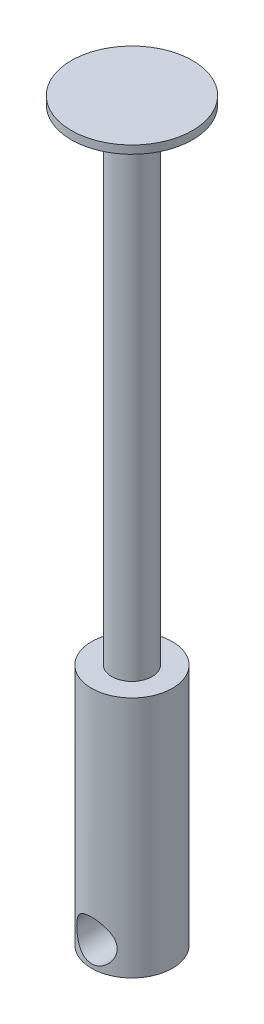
ISO-10303-21;
HEADER;
FILE_DESCRIPTION(('STEP AP214'),'2;1');
FILE_NAME('part.step','',(''),(''),'','','');
FILE_SCHEMA(('AUTOMOTIVE_DESIGN { 1 0 10303 214 1 1 1 1 }'));
ENDSEC;
DATA;
#1=APPLICATION_CONTEXT('core data for automotive mechanical design processes');
#2=APPLICATION_PROTOCOL_DEFINITION('international standard','automotive_design',2000,#1);
#3=PRODUCT_CONTEXT('',#1,'mechanical');
#4=PRODUCT('Part','Part','',(#3));
#5=PRODUCT_RELATED_PRODUCT_CATEGORY('part','',(#4));
#6=PRODUCT_DEFINITION_FORMATION('','',#4);
#7=PRODUCT_DEFINITION_CONTEXT('part definition',#1,'design');
#8=PRODUCT_DEFINITION('design','',#6,#7);
#9=PRODUCT_DEFINITION_SHAPE('','',#8);
#10=(LENGTH_UNIT() NAMED_UNIT(*) SI_UNIT(.MILLI.,.METRE.));
#11=(NAMED_UNIT(*) PLANE_ANGLE_UNIT() SI_UNIT($,.RADIAN.));
#12=(NAMED_UNIT(*) SI_UNIT($,.STERADIAN.) SOLID_ANGLE_UNIT());
#13=UNCERTAINTY_MEASURE_WITH_UNIT(LENGTH_MEASURE(1.E-05),#10,'distance_accuracy_value','');
#14=(GEOMETRIC_REPRESENTATION_CONTEXT(3) GLOBAL_UNCERTAINTY_ASSIGNED_CONTEXT((#13)) GLOBAL_UNIT_ASSIGNED_CONTEXT((#10,
#11,#12)) REPRESENTATION_CONTEXT('',''));
#15=CARTESIAN_POINT('',(0.,0.,0.));
#16=DIRECTION('',(0.,0.,1.));
#17=DIRECTION('',(1.,0.,0.));
#18=AXIS2_PLACEMENT_3D('',#15,#16,#17);
#19=CARTESIAN_POINT('',(0.,30.,0.));
#20=DIRECTION('',(0.,-1.,0.));
#21=DIRECTION('',(0.,0.,-1.));
#22=AXIS2_PLACEMENT_3D('',#19,#20,#21);
#23=CYLINDRICAL_SURFACE('',#22,5.);
#24=CARTESIAN_POINT('',(0.,5.50000000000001,-5.));
#25=CARTESIAN_POINT('',(-0.131426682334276,5.499990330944,-4.99999177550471));
#26=CARTESIAN_POINT('',(-0.263015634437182,5.48957443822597,-4.99476199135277));
#27=CARTESIAN_POINT('',(-0.522301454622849,5.44836817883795,-4.9743541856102));
#28=CARTESIAN_POINT('',(-0.649990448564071,5.41753911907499,-4.9591572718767));
#29=CARTESIAN_POINT('',(-0.897333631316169,5.33701537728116,-4.92040690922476));
#30=CARTESIAN_POINT('',(-1.01701694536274,5.28739401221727,-4.89688595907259));
#31=CARTESIAN_POINT('',(-1.24618160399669,5.17107347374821,-4.84364443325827));
#32=CARTESIAN_POINT('',(-1.35566375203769,5.10437564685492,-4.81392434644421));
#33=CARTESIAN_POINT('',(-1.56876952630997,4.95120686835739,-4.74890645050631));
#34=CARTESIAN_POINT('',(-1.67163802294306,4.86378379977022,-4.71337997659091));
#35=CARTESIAN_POINT('',(-1.8619486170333,4.67369630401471,-4.64149925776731));
#36=CARTESIAN_POINT('',(-1.94937895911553,4.5710203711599,-4.60514440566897));
#37=CARTESIAN_POINT('',(-2.11312999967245,4.34379162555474,-4.53247377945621));
#38=CARTESIAN_POINT('',(-2.18806333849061,4.218159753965,-4.49637967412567));
#39=CARTESIAN_POINT('',(-2.31542056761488,3.95408166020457,-4.43214946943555));
#40=CARTESIAN_POINT('',(-2.36786053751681,3.81564467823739,-4.40400769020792));
#41=CARTESIAN_POINT('',(-2.44533110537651,3.5383372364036,-4.36144667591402));
#42=CARTESIAN_POINT('',(-2.47181464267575,3.39998886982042,-4.34630678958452));
#43=CARTESIAN_POINT('',(-2.50106748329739,3.1200529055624,-4.3295472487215));
#44=CARTESIAN_POINT('',(-2.50386022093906,2.97846864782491,-4.32791423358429));
#45=CARTESIAN_POINT('',(-2.48671821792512,2.71428493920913,-4.33777325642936));
#46=CARTESIAN_POINT('',(-2.46946139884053,2.59143992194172,-4.34771909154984));
#47=CARTESIAN_POINT('',(-2.41734962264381,2.35069522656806,-4.37690571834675));
#48=CARTESIAN_POINT('',(-2.38248905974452,2.23279713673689,-4.39614947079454));
#49=CARTESIAN_POINT('',(-2.29552445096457,2.00192716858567,-4.44218691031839));
#50=CARTESIAN_POINT('',(-2.24303766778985,1.88913400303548,-4.46914601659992));
#51=CARTESIAN_POINT('',(-2.1226042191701,1.67341426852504,-4.52758510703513));
#52=CARTESIAN_POINT('',(-2.05465060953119,1.5704921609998,-4.55906711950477));
#53=CARTESIAN_POINT('',(-1.89516513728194,1.36369686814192,-4.62782894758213));
#54=CARTESIAN_POINT('',(-1.80173614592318,1.26135781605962,-4.66533775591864));
#55=CARTESIAN_POINT('',(-1.59888894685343,1.07316145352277,-4.73869058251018));
#56=CARTESIAN_POINT('',(-1.4894631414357,0.987312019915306,-4.77453379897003));
#57=CARTESIAN_POINT('',(-1.25129126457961,0.830785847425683,-4.84254968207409));
#58=CARTESIAN_POINT('',(-1.12188397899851,0.760998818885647,-4.87447460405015));
#59=CARTESIAN_POINT('',(-0.851165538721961,0.644757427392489,-4.92894702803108));
#60=CARTESIAN_POINT('',(-0.709863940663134,0.598284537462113,-4.95150197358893));
#61=CARTESIAN_POINT('',(-0.431916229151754,0.533811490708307,-4.98310834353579));
#62=CARTESIAN_POINT('',(-0.295853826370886,0.513771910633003,-4.9931234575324));
#63=CARTESIAN_POINT('',(-0.0219489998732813,0.49633817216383,-5.00182533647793));
#64=CARTESIAN_POINT('',(0.11589254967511,0.49893328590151,-5.00051746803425));
#65=CARTESIAN_POINT('',(0.378082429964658,0.525516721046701,-4.98727980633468));
#66=CARTESIAN_POINT('',(0.502648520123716,0.547831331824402,-4.97618114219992));
#67=CARTESIAN_POINT('',(0.746017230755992,0.610595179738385,-4.94555428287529));
#68=CARTESIAN_POINT('',(0.864819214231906,0.651046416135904,-4.92602515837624));
#69=CARTESIAN_POINT('',(1.09722152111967,0.749996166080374,-4.87960628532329));
#70=CARTESIAN_POINT('',(1.21057599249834,0.808977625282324,-4.85252204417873));
#71=CARTESIAN_POINT('',(1.42615340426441,0.942768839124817,-4.7935993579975));
#72=CARTESIAN_POINT('',(1.52837157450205,1.01758533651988,-4.76175888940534));
#73=CARTESIAN_POINT('',(1.72941922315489,1.18940106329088,-4.69270553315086));
#74=CARTESIAN_POINT('',(1.82693019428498,1.28785717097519,-4.65527212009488));
#75=CARTESIAN_POINT('',(2.00464080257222,1.49981287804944,-4.58155978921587));
#76=CARTESIAN_POINT('',(2.08482846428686,1.61332279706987,-4.54528168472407));
#77=CARTESIAN_POINT('',(2.22926978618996,1.85910913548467,-4.47627980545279));
#78=CARTESIAN_POINT('',(2.29256373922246,1.99202816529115,-4.44381323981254));
#79=CARTESIAN_POINT('',(2.39520706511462,2.26877516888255,-4.38935180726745));
#80=CARTESIAN_POINT('',(2.4345872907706,2.41258881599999,-4.36734345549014));
#81=CARTESIAN_POINT('',(2.48465421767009,2.69227555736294,-4.33903752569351));
#82=CARTESIAN_POINT('',(2.49773248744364,2.82758563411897,-4.33143458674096));
#83=CARTESIAN_POINT('',(2.501722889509,3.09861766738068,-4.32913386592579));
#84=CARTESIAN_POINT('',(2.49264462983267,3.23433941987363,-4.3344304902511));
#85=CARTESIAN_POINT('',(2.45481530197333,3.48870875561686,-4.35594655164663));
#86=CARTESIAN_POINT('',(2.42802074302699,3.60775118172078,-4.37107736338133));
#87=CARTESIAN_POINT('',(2.35793843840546,3.83952029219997,-4.40927540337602));
#88=CARTESIAN_POINT('',(2.31464538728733,3.95224493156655,-4.43234518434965));
#89=CARTESIAN_POINT('',(2.20953919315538,4.17656215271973,-4.48571326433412));
#90=CARTESIAN_POINT('',(2.14667719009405,4.28756985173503,-4.5163930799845));
#91=CARTESIAN_POINT('',(2.00537808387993,4.49818624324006,-4.58088327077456));
#92=CARTESIAN_POINT('',(1.92693287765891,4.59778896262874,-4.61469526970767));
#93=CARTESIAN_POINT('',(1.74550556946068,4.79535536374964,-4.6865581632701));
#94=CARTESIAN_POINT('',(1.64070022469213,4.89164936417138,-4.7246249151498));
#95=CARTESIAN_POINT('',(1.41539785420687,5.06565584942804,-4.79694347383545));
#96=CARTESIAN_POINT('',(1.29489242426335,5.14335831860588,-4.83119321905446));
#97=CARTESIAN_POINT('',(1.03978808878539,5.2780969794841,-4.89245149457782));
#98=CARTESIAN_POINT('',(0.905095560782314,5.33498316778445,-4.91940711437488));
#99=CARTESIAN_POINT('',(0.696328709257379,5.4021838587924,-4.9517796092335));
#100=CARTESIAN_POINT('',(0.625670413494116,5.42155539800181,-4.96122314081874));
#101=CARTESIAN_POINT('',(0.482623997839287,5.4540659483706,-4.97717127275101));
#102=CARTESIAN_POINT('',(0.410236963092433,5.46720876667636,-4.98367766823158));
#103=CARTESIAN_POINT('',(0.281518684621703,5.48473747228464,-4.9923820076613));
#104=CARTESIAN_POINT('',(0.225408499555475,5.49045493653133,-4.99523288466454));
#105=CARTESIAN_POINT('',(0.112875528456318,5.49808832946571,-4.99904367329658));
#106=CARTESIAN_POINT('',(0.0564527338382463,5.50000415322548,-5.00000353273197));
#107=CARTESIAN_POINT('',(0.,5.50000000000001,-5.));
#108=B_SPLINE_CURVE_WITH_KNOTS('',3,(#24,#25,#26,#27,#28,#29,#30,#31,#32,#33,#34,#35,#36,#37,
#38,#39,#40,#41,#42,#43,#44,#45,#46,#47,#48,#49,#50,#51,#52,#53,#54,#55,#56,#57,#58,#59,#60,#61,
#62,#63,#64,#65,#66,#67,#68,#69,#70,#71,#72,#73,#74,#75,#76,#77,#78,#79,#80,#81,#82,#83,#84,#85,
#86,#87,#88,#89,#90,#91,#92,#93,#94,#95,#96,#97,#98,#99,#100,#101,#102,#103,#104,#105,#106,
#107),.UNSPECIFIED.,.T.,.F.,(4,2,2,2,2,2,2,2,2,2,2,2,2,2,2,2,2,2,2,2,2,2,2,2,2,2,2,2,2,2,2,2,2,
2,2,2,2,2,2,2,2,4),(0.,0.394060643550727,0.788870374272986,1.18215538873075,1.57540940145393,
1.99245439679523,2.40981559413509,2.85954316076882,3.30894869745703,3.73145030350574,
4.15353393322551,4.52514281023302,4.89687009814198,5.27725600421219,5.65781303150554,
6.08662353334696,6.51563836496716,6.96457555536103,7.41315542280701,7.82458226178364,
8.23581411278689,8.61517266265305,8.99457304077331,9.38482140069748,9.77523626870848,
10.2039902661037,10.6330397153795,11.0828670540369,11.53211279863,11.9382326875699,
12.3441764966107,12.7114482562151,13.0788382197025,13.4709114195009,13.8631890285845,
14.303131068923,14.7433095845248,15.1866003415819,15.407934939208,15.6291340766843,
15.7983933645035,15.9676573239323),.UNSPECIFIED.);
#109=CARTESIAN_POINT('',(0.,5.50000000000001,-5.));
#110=VERTEX_POINT('',#109);
#111=EDGE_CURVE('E36',#110,#110,#108,.T.);
#112=ORIENTED_EDGE('',*,*,#111,.T.);
#113=EDGE_LOOP('',(#112));
#114=FACE_BOUND('',#113,.T.);
#115=CARTESIAN_POINT('',(2.5,3.,4.33012701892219));
#116=CARTESIAN_POINT('',(2.4999894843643,2.86973349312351,4.33013982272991));
#117=CARTESIAN_POINT('',(2.48974954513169,2.73929727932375,4.33609541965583));
#118=CARTESIAN_POINT('',(2.44930840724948,2.48243102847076,4.35905877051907));
#119=CARTESIAN_POINT('',(2.41906526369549,2.3560099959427,4.37608974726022));
#120=CARTESIAN_POINT('',(2.34024976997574,2.11137105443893,4.41873376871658));
#121=CARTESIAN_POINT('',(2.29177485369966,1.99311342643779,4.44430111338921));
#122=CARTESIAN_POINT('',(2.17816884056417,1.76643943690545,4.50106659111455));
#123=CARTESIAN_POINT('',(2.11303684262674,1.65802360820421,4.53226502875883));
#124=CARTESIAN_POINT('',(1.96166634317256,1.44423569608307,4.5999217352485));
#125=CARTESIAN_POINT('',(1.8741300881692,1.33985216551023,4.63660159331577));
#126=CARTESIAN_POINT('',(1.68313452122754,1.1464790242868,4.70929956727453));
#127=CARTESIAN_POINT('',(1.57966731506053,1.05749709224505,4.74531734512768));
#128=CARTESIAN_POINT('',(1.35122390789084,0.891582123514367,4.81553692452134));
#129=CARTESIAN_POINT('',(1.22526797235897,0.815865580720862,4.84945266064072));
#130=CARTESIAN_POINT('',(0.960392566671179,0.687147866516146,4.90876890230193));
#131=CARTESIAN_POINT('',(0.821481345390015,0.634132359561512,4.93417477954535));
#132=CARTESIAN_POINT('',(0.545112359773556,0.556238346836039,4.9720115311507));
#133=CARTESIAN_POINT('',(0.408254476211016,0.529626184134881,4.98523700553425));
#134=CARTESIAN_POINT('',(0.131426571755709,0.499584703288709,5.00018959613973));
#135=CARTESIAN_POINT('',(-0.00854151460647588,0.496141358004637,5.00192366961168));
#136=CARTESIAN_POINT('',(-0.274581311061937,0.511866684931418,4.99407454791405));
#137=CARTESIAN_POINT('',(-0.400802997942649,0.529095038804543,4.98546239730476));
#138=CARTESIAN_POINT('',(-0.648284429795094,0.582202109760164,4.95935613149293));
#139=CARTESIAN_POINT('',(-0.769543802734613,0.618082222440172,4.94186135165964));
#140=CARTESIAN_POINT('',(-1.00577347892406,0.707706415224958,4.89928958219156));
#141=CARTESIAN_POINT('',(-1.12063355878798,0.76169078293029,4.87411103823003));
#142=CARTESIAN_POINT('',(-1.33994200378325,0.885658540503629,4.81844114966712));
#143=CARTESIAN_POINT('',(-1.44438662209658,0.955647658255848,4.78794790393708));
#144=CARTESIAN_POINT('',(-1.65043415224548,1.11723837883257,4.72110985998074));
#145=CARTESIAN_POINT('',(-1.75083518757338,1.21025757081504,4.68448439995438));
#146=CARTESIAN_POINT('',(-1.93526092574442,1.41147431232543,4.61135851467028));
#147=CARTESIAN_POINT('',(-2.01927302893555,1.51968343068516,4.57485820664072));
#148=CARTESIAN_POINT('',(-2.1737633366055,1.75662048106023,4.50360390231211));
#149=CARTESIAN_POINT('',(-2.2430432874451,1.88621505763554,4.46910799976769));
#150=CARTESIAN_POINT('',(-2.35829778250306,2.15734417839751,4.40938625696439));
#151=CARTESIAN_POINT('',(-2.40429664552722,2.29886608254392,4.38415075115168));
#152=CARTESIAN_POINT('',(-2.46795052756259,2.57803627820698,4.34861589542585));
#153=CARTESIAN_POINT('',(-2.48756280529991,2.71510279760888,4.33729139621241));
#154=CARTESIAN_POINT('',(-2.50379236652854,2.99100335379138,4.32794798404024));
#155=CARTESIAN_POINT('',(-2.50042589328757,3.12983607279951,4.32991967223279));
#156=CARTESIAN_POINT('',(-2.4725901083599,3.3891347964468,4.34585841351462));
#157=CARTESIAN_POINT('',(-2.45046954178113,3.50994862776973,4.35848968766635));
#158=CARTESIAN_POINT('',(-2.38924071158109,3.74591946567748,4.39235053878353));
#159=CARTESIAN_POINT('',(-2.35012694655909,3.86107462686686,4.41358290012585));
#160=CARTESIAN_POINT('',(-2.25411897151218,4.0885283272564,4.46340555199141));
#161=CARTESIAN_POINT('',(-2.19648515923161,4.20044754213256,4.49229108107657));
#162=CARTESIAN_POINT('',(-2.06571766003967,4.41367317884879,4.55390298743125));
#163=CARTESIAN_POINT('',(-1.99257601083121,4.51497410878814,4.58663133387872));
#164=CARTESIAN_POINT('',(-1.82209291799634,4.71744691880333,4.65719996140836));
#165=CARTESIAN_POINT('',(-1.72286318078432,4.81699287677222,4.69516457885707));
#166=CARTESIAN_POINT('',(-1.50851123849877,4.99853059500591,4.76835587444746));
#167=CARTESIAN_POINT('',(-1.39338368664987,5.08051642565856,4.80358162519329));
#168=CARTESIAN_POINT('',(-1.14633840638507,5.2264343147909,4.86853404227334));
#169=CARTESIAN_POINT('',(-1.01405774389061,5.28983279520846,4.89809104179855));
#170=CARTESIAN_POINT('',(-0.738805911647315,5.39284475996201,4.9470838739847));
#171=CARTESIAN_POINT('',(-0.595844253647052,5.43247912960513,4.96652859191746));
#172=CARTESIAN_POINT('',(-0.317449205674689,5.48342140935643,4.99168770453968));
#173=CARTESIAN_POINT('',(-0.182528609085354,5.49699468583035,4.99849819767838));
#174=CARTESIAN_POINT('',(0.0878149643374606,5.5021081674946,5.00105325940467));
#175=CARTESIAN_POINT('',(0.22323774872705,5.4936560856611,4.99680170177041));
#176=CARTESIAN_POINT('',(0.481344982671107,5.45645896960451,4.97834922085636));
#177=CARTESIAN_POINT('',(0.604280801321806,5.42908782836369,4.96482236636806));
#178=CARTESIAN_POINT('',(0.843614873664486,5.35668255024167,4.92980234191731));
#179=CARTESIAN_POINT('',(0.960012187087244,5.31164588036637,4.90830802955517));
#180=CARTESIAN_POINT('',(1.18855854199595,5.20318218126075,4.85814826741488));
#181=CARTESIAN_POINT('',(1.30031295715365,5.13905097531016,4.82921542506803));
#182=CARTESIAN_POINT('',(1.51193650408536,4.99510588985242,4.76720333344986));
#183=CARTESIAN_POINT('',(1.61180014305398,4.91528480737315,4.73412218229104));
#184=CARTESIAN_POINT('',(1.80728542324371,4.73300420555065,4.66321523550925));
#185=CARTESIAN_POINT('',(1.90149582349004,4.62908227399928,4.62524489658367));
#186=CARTESIAN_POINT('',(2.07165660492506,4.40638471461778,4.55157698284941));
#187=CARTESIAN_POINT('',(2.14759083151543,4.28759608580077,4.51588143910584));
#188=CARTESIAN_POINT('',(2.28108393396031,4.03336388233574,4.44998982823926));
#189=CARTESIAN_POINT('',(2.33798627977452,3.8975126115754,4.42000320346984));
#190=CARTESIAN_POINT('',(2.40494911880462,3.68677735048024,4.38370272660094));
#191=CARTESIAN_POINT('',(2.42419582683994,3.6154402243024,4.37305486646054));
#192=CARTESIAN_POINT('',(2.4563508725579,3.47095930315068,4.35507574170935));
#193=CARTESIAN_POINT('',(2.46926364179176,3.39781680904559,4.34774215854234));
#194=CARTESIAN_POINT('',(2.48591166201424,3.27049901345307,4.3382377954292));
#195=CARTESIAN_POINT('',(2.49118864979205,3.2165836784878,4.33520487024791));
#196=CARTESIAN_POINT('',(2.49823512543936,3.1084553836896,4.33114674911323));
#197=CARTESIAN_POINT('',(2.50000437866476,3.05424240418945,4.33012168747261));
#198=CARTESIAN_POINT('',(2.5,3.,4.33012701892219));
#199=B_SPLINE_CURVE_WITH_KNOTS('',3,(#115,#116,#117,#118,#119,#120,#121,#122,#123,#124,#125,
#126,#127,#128,#129,#130,#131,#132,#133,#134,#135,#136,#137,#138,#139,#140,#141,#142,#143,#144,
#145,#146,#147,#148,#149,#150,#151,#152,#153,#154,#155,#156,#157,#158,#159,#160,#161,#162,#163,
#164,#165,#166,#167,#168,#169,#170,#171,#172,#173,#174,#175,#176,#177,#178,#179,#180,#181,#182,
#183,#184,#185,#186,#187,#188,#189,#190,#191,#192,#193,#194,#195,#196,#197,#198),.UNSPECIFIED.,
.T.,.F.,(4,2,2,2,2,2,2,2,2,2,2,2,2,2,2,2,2,2,2,2,2,2,2,2,2,2,2,2,2,2,2,2,2,2,2,2,2,2,2,2,2,4),
(0.,0.390580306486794,0.781982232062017,1.17132148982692,1.56068181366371,1.98215578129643,
2.40383927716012,2.85394730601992,3.3037706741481,3.72158712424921,4.13915059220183,
4.5204024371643,4.90168281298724,5.28823836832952,5.67493248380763,6.0981797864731,
6.5217512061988,6.97222104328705,7.42221935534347,7.83655727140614,8.25060232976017,
8.61935458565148,8.9882263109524,9.37418241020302,9.76033715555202,10.1951685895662,
10.6301466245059,11.076604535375,11.5226694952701,11.927806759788,12.3328021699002,
12.7111106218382,13.0894733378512,13.4840187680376,13.8787457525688,14.3127560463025,
14.7471485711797,15.195268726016,15.4189244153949,15.6424233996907,15.8050484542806,
15.9676843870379),.UNSPECIFIED.);
#200=CARTESIAN_POINT('',(2.5,3.,4.33012701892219));
#201=VERTEX_POINT('',#200);
#202=EDGE_CURVE('E53',#201,#201,#199,.T.);
#203=ORIENTED_EDGE('',*,*,#202,.T.);
#204=EDGE_LOOP('',(#203));
#205=FACE_BOUND('',#204,.T.);
#206=CARTESIAN_POINT('',(0.,30.,0.));
#207=DIRECTION('',(0.,1.,0.));
#208=DIRECTION('',(0.,0.,1.));
#209=AXIS2_PLACEMENT_3D('',#206,#207,#208);
#210=CIRCLE('',#209,5.);
#211=CARTESIAN_POINT('',(0.,30.,5.));
#212=VERTEX_POINT('',#211);
#213=EDGE_CURVE('E10',#212,#212,#210,.T.);
#214=ORIENTED_EDGE('',*,*,#213,.F.);
#215=EDGE_LOOP('',(#214));
#216=FACE_BOUND('',#215,.T.);
#217=CARTESIAN_POINT('',(0.,0.,0.));
#218=DIRECTION('',(0.,1.,0.));
#219=DIRECTION('',(0.,0.,1.));
#220=AXIS2_PLACEMENT_3D('',#217,#218,#219);
#221=CIRCLE('',#220,5.);
#222=CARTESIAN_POINT('',(0.,0.,5.));
#223=VERTEX_POINT('',#222);
#224=EDGE_CURVE('E43',#223,#223,#221,.T.);
#225=ORIENTED_EDGE('',*,*,#224,.T.);
#226=EDGE_LOOP('',(#225));
#227=FACE_BOUND('',#226,.T.);
#228=ADVANCED_FACE('F32',(#114,#205,#216,#227),#23,.T.);
#229=CARTESIAN_POINT('',(0.,30.,0.));
#230=DIRECTION('',(0.,1.,0.));
#231=DIRECTION('',(0.,0.,1.));
#232=AXIS2_PLACEMENT_3D('',#229,#230,#231);
#233=PLANE('',#232);
#234=CARTESIAN_POINT('',(0.,30.,0.));
#235=DIRECTION('',(0.,1.,0.));
#236=DIRECTION('',(0.,0.,1.));
#237=AXIS2_PLACEMENT_3D('',#234,#235,#236);
#238=CIRCLE('',#237,2.5);
#239=CARTESIAN_POINT('',(0.,30.,-2.5));
#240=VERTEX_POINT('',#239);
#241=EDGE_CURVE('E51',#240,#240,#238,.T.);
#242=ORIENTED_EDGE('',*,*,#241,.F.);
#243=EDGE_LOOP('',(#242));
#244=FACE_BOUND('',#243,.T.);
#245=ORIENTED_EDGE('',*,*,#213,.T.);
#246=EDGE_LOOP('',(#245));
#247=FACE_BOUND('',#246,.T.);
#248=ADVANCED_FACE('F80',(#244,#247),#233,.T.);
#249=CARTESIAN_POINT('',(0.,0.,0.));
#250=DIRECTION('',(0.,1.,0.));
#251=DIRECTION('',(0.,0.,1.));
#252=AXIS2_PLACEMENT_3D('',#249,#250,#251);
#253=PLANE('',#252);
#254=ORIENTED_EDGE('',*,*,#224,.F.);
#255=EDGE_LOOP('',(#254));
#256=FACE_BOUND('',#255,.T.);
#257=ADVANCED_FACE('F78',(#256),#253,.F.);
#258=CARTESIAN_POINT('',(0.,90.,0.));
#259=DIRECTION('',(0.,-1.,0.));
#260=DIRECTION('',(0.,0.,-1.));
#261=AXIS2_PLACEMENT_3D('',#258,#259,#260);
#262=CYLINDRICAL_SURFACE('',#261,2.5);
#263=CARTESIAN_POINT('',(0.,90.,0.));
#264=DIRECTION('',(0.,1.,0.));
#265=DIRECTION('',(0.,0.,1.));
#266=AXIS2_PLACEMENT_3D('',#263,#264,#265);
#267=CIRCLE('',#266,2.5);
#268=CARTESIAN_POINT('',(0.,90.,-2.5));
#269=VERTEX_POINT('',#268);
#270=EDGE_CURVE('E48',#269,#269,#267,.T.);
#271=CARTESIAN_POINT('',(0.,90.,-2.5));
#272=CARTESIAN_POINT('',(0.,89.375,-2.5));
#273=CARTESIAN_POINT('',(0.,88.75,-2.5));
#274=CARTESIAN_POINT('',(0.,87.5,-2.5));
#275=CARTESIAN_POINT('',(0.,86.875,-2.5));
#276=CARTESIAN_POINT('',(0.,85.625,-2.5));
#277=CARTESIAN_POINT('',(0.,85.,-2.5));
#278=CARTESIAN_POINT('',(0.,83.75,-2.5));
#279=CARTESIAN_POINT('',(0.,83.125,-2.5));
#280=CARTESIAN_POINT('',(0.,81.875,-2.5));
#281=CARTESIAN_POINT('',(0.,81.25,-2.5));
#282=CARTESIAN_POINT('',(0.,80.,-2.5));
#283=CARTESIAN_POINT('',(0.,79.375,-2.5));
#284=CARTESIAN_POINT('',(0.,78.125,-2.5));
#285=CARTESIAN_POINT('',(0.,77.5,-2.5));
#286=CARTESIAN_POINT('',(0.,76.25,-2.5));
#287=CARTESIAN_POINT('',(0.,75.625,-2.5));
#288=CARTESIAN_POINT('',(0.,74.375,-2.5));
#289=CARTESIAN_POINT('',(0.,73.75,-2.5));
#290=CARTESIAN_POINT('',(0.,72.5,-2.5));
#291=CARTESIAN_POINT('',(0.,71.875,-2.5));
#292=CARTESIAN_POINT('',(0.,70.625,-2.5));
#293=CARTESIAN_POINT('',(0.,70.,-2.5));
#294=CARTESIAN_POINT('',(0.,68.75,-2.5));
#295=CARTESIAN_POINT('',(0.,68.125,-2.5));
#296=CARTESIAN_POINT('',(0.,66.875,-2.5));
#297=CARTESIAN_POINT('',(0.,66.25,-2.5));
#298=CARTESIAN_POINT('',(0.,65.,-2.5));
#299=CARTESIAN_POINT('',(0.,64.375,-2.5));
#300=CARTESIAN_POINT('',(0.,63.125,-2.5));
#301=CARTESIAN_POINT('',(0.,62.5,-2.5));
#302=CARTESIAN_POINT('',(0.,61.25,-2.5));
#303=CARTESIAN_POINT('',(0.,60.625,-2.5));
#304=CARTESIAN_POINT('',(0.,59.375,-2.5));
#305=CARTESIAN_POINT('',(0.,58.75,-2.5));
#306=CARTESIAN_POINT('',(0.,57.5,-2.5));
#307=CARTESIAN_POINT('',(0.,56.875,-2.5));
#308=CARTESIAN_POINT('',(0.,55.625,-2.5));
#309=CARTESIAN_POINT('',(0.,55.,-2.5));
#310=CARTESIAN_POINT('',(0.,53.75,-2.5));
#311=CARTESIAN_POINT('',(0.,53.125,-2.5));
#312=CARTESIAN_POINT('',(0.,51.875,-2.5));
#313=CARTESIAN_POINT('',(0.,51.25,-2.5));
#314=CARTESIAN_POINT('',(0.,50.,-2.5));
#315=CARTESIAN_POINT('',(0.,49.375,-2.5));
#316=CARTESIAN_POINT('',(0.,48.125,-2.5));
#317=CARTESIAN_POINT('',(0.,47.5,-2.5));
#318=CARTESIAN_POINT('',(0.,46.25,-2.5));
#319=CARTESIAN_POINT('',(0.,45.625,-2.5));
#320=CARTESIAN_POINT('',(0.,44.375,-2.5));
#321=CARTESIAN_POINT('',(0.,43.75,-2.5));
#322=CARTESIAN_POINT('',(0.,42.5,-2.5));
#323=CARTESIAN_POINT('',(0.,41.875,-2.5));
#324=CARTESIAN_POINT('',(0.,40.625,-2.5));
#325=CARTESIAN_POINT('',(0.,40.,-2.5));
#326=CARTESIAN_POINT('',(0.,38.75,-2.5));
#327=CARTESIAN_POINT('',(0.,38.125,-2.5));
#328=CARTESIAN_POINT('',(0.,36.875,-2.5));
#329=CARTESIAN_POINT('',(0.,36.25,-2.5));
#330=CARTESIAN_POINT('',(0.,35.,-2.5));
#331=CARTESIAN_POINT('',(0.,34.375,-2.5));
#332=CARTESIAN_POINT('',(0.,33.125,-2.5));
#333=CARTESIAN_POINT('',(0.,32.5,-2.5));
#334=CARTESIAN_POINT('',(0.,31.25,-2.5));
#335=CARTESIAN_POINT('',(0.,30.625,-2.5));
#336=CARTESIAN_POINT('',(0.,30.,-2.5));
#337=B_SPLINE_CURVE_WITH_KNOTS('',3,(#271,#272,#273,#274,#275,#276,#277,#278,#279,#280,#281,
#282,#283,#284,#285,#286,#287,#288,#289,#290,#291,#292,#293,#294,#295,#296,#297,#298,#299,#300,
#301,#302,#303,#304,#305,#306,#307,#308,#309,#310,#311,#312,#313,#314,#315,#316,#317,#318,#319,
#320,#321,#322,#323,#324,#325,#326,#327,#328,#329,#330,#331,#332,#333,#334,#335,#336),
.UNSPECIFIED.,.F.,.F.,(4,2,2,2,2,2,2,2,2,2,2,2,2,2,2,2,2,2,2,2,2,2,2,2,2,2,2,2,2,2,2,2,4),(0.,
1.87499999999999,3.74999999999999,5.62499999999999,7.49999999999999,9.37499999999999,11.25,
13.125,15.,16.875,18.75,20.625,22.5,24.375,26.25,28.125,30.,31.875,33.75,35.625,37.5,39.375,
41.25,43.125,45.,46.875,48.75,50.625,52.5,54.375,56.25,58.125,60.),.UNSPECIFIED.);
#338=EDGE_CURVE('BSEAM74',#269,#240,#337,.T.);
#339=ORIENTED_EDGE('',*,*,#270,.F.);
#340=ORIENTED_EDGE('',*,*,#241,.T.);
#341=ORIENTED_EDGE('',*,*,#338,.T.);
#342=ORIENTED_EDGE('',*,*,#338,.F.);
#343=EDGE_LOOP('',(#339,#341,#340,#342));
#344=FACE_BOUND('',#343,.T.);
#345=ADVANCED_FACE('F74',(#344),#262,.T.);
#346=CARTESIAN_POINT('',(0.,91.,0.));
#347=DIRECTION('',(0.,-1.,0.));
#348=DIRECTION('',(0.,0.,-1.));
#349=AXIS2_PLACEMENT_3D('',#346,#347,#348);
#350=CYLINDRICAL_SURFACE('',#349,7.5);
#351=CARTESIAN_POINT('',(0.,91.,0.));
#352=DIRECTION('',(0.,1.,0.));
#353=DIRECTION('',(0.,0.,1.));
#354=AXIS2_PLACEMENT_3D('',#351,#352,#353);
#355=CIRCLE('',#354,7.5);
#356=CARTESIAN_POINT('',(0.,91.,7.5));
#357=VERTEX_POINT('',#356);
#358=EDGE_CURVE('E101',#357,#357,#355,.T.);
#359=ORIENTED_EDGE('',*,*,#358,.F.);
#360=EDGE_LOOP('',(#359));
#361=FACE_BOUND('',#360,.T.);
#362=CARTESIAN_POINT('',(0.,90.,0.));
#363=DIRECTION('',(0.,1.,0.));
#364=DIRECTION('',(0.,0.,1.));
#365=AXIS2_PLACEMENT_3D('',#362,#363,#364);
#366=CIRCLE('',#365,7.5);
#367=CARTESIAN_POINT('',(0.,90.,7.5));
#368=VERTEX_POINT('',#367);
#369=EDGE_CURVE('E99',#368,#368,#366,.T.);
#370=ORIENTED_EDGE('',*,*,#369,.T.);
#371=EDGE_LOOP('',(#370));
#372=FACE_BOUND('',#371,.T.);
#373=ADVANCED_FACE('F67',(#361,#372),#350,.T.);
#374=CARTESIAN_POINT('',(0.,91.,0.));
#375=DIRECTION('',(0.,1.,0.));
#376=DIRECTION('',(0.,0.,1.));
#377=AXIS2_PLACEMENT_3D('',#374,#375,#376);
#378=PLANE('',#377);
#379=ORIENTED_EDGE('',*,*,#358,.T.);
#380=EDGE_LOOP('',(#379));
#381=FACE_BOUND('',#380,.T.);
#382=ADVANCED_FACE('F63',(#381),#378,.T.);
#383=CARTESIAN_POINT('',(0.,90.,0.));
#384=DIRECTION('',(0.,1.,0.));
#385=DIRECTION('',(0.,0.,1.));
#386=AXIS2_PLACEMENT_3D('',#383,#384,#385);
#387=PLANE('',#386);
#388=ORIENTED_EDGE('',*,*,#270,.T.);
#389=EDGE_LOOP('',(#388));
#390=FACE_BOUND('',#389,.T.);
#391=ORIENTED_EDGE('',*,*,#369,.F.);
#392=EDGE_LOOP('',(#391));
#393=FACE_BOUND('',#392,.T.);
#394=ADVANCED_FACE('F61',(#390,#393),#387,.F.);
#395=CARTESIAN_POINT('',(0.,3.,-7.5));
#396=DIRECTION('',(0.,0.,1.));
#397=DIRECTION('',(1.,0.,0.));
#398=AXIS2_PLACEMENT_3D('',#395,#396,#397);
#399=CYLINDRICAL_SURFACE('',#398,2.5);
#400=ORIENTED_EDGE('',*,*,#202,.F.);
#401=EDGE_LOOP('',(#400));
#402=FACE_BOUND('',#401,.T.);
#403=ORIENTED_EDGE('',*,*,#111,.F.);
#404=EDGE_LOOP('',(#403));
#405=FACE_BOUND('',#404,.T.);
#406=ADVANCED_FACE('F57',(#402,#405),#399,.F.);
#407=CLOSED_SHELL('',(#228,#248,#257,#345,#373,#382,#394,#406));
#408=MANIFOLD_SOLID_BREP('B2',#407);
#409=ADVANCED_BREP_SHAPE_REPRESENTATION('',(#18,#408),#14);
#410=SHAPE_DEFINITION_REPRESENTATION(#9,#409);
ENDSEC;
END-ISO-10303-21;
